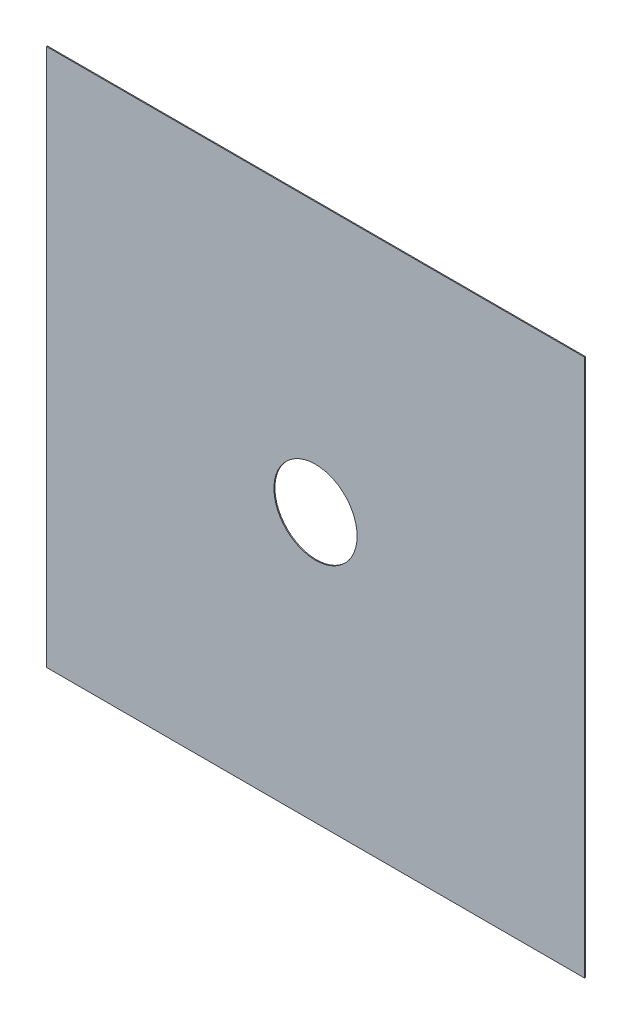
ISO-10303-21;
HEADER;
FILE_DESCRIPTION(('STEP AP214'),'2;1');
FILE_NAME('part.step','',(''),(''),'','','');
FILE_SCHEMA(('AUTOMOTIVE_DESIGN { 1 0 10303 214 1 1 1 1 }'));
ENDSEC;
DATA;
#1=APPLICATION_CONTEXT('core data for automotive mechanical design processes');
#2=APPLICATION_PROTOCOL_DEFINITION('international standard','automotive_design',2000,#1);
#3=PRODUCT_CONTEXT('',#1,'mechanical');
#4=PRODUCT('Part','Part','',(#3));
#5=PRODUCT_RELATED_PRODUCT_CATEGORY('part','',(#4));
#6=PRODUCT_DEFINITION_FORMATION('','',#4);
#7=PRODUCT_DEFINITION_CONTEXT('part definition',#1,'design');
#8=PRODUCT_DEFINITION('design','',#6,#7);
#9=PRODUCT_DEFINITION_SHAPE('','',#8);
#10=(LENGTH_UNIT() NAMED_UNIT(*) SI_UNIT(.MILLI.,.METRE.));
#11=(NAMED_UNIT(*) PLANE_ANGLE_UNIT() SI_UNIT($,.RADIAN.));
#12=(NAMED_UNIT(*) SI_UNIT($,.STERADIAN.) SOLID_ANGLE_UNIT());
#13=UNCERTAINTY_MEASURE_WITH_UNIT(LENGTH_MEASURE(1.E-05),#10,'distance_accuracy_value','');
#14=(GEOMETRIC_REPRESENTATION_CONTEXT(3) GLOBAL_UNCERTAINTY_ASSIGNED_CONTEXT((#13)) GLOBAL_UNIT_ASSIGNED_CONTEXT((#10,
#11,#12)) REPRESENTATION_CONTEXT('',''));
#15=CARTESIAN_POINT('',(0.,0.,0.));
#16=DIRECTION('',(0.,0.,1.));
#17=DIRECTION('',(1.,0.,0.));
#18=AXIS2_PLACEMENT_3D('',#15,#16,#17);
#19=CARTESIAN_POINT('',(0.,0.,3.));
#20=DIRECTION('',(0.,0.,1.));
#21=DIRECTION('',(1.,0.,0.));
#22=AXIS2_PLACEMENT_3D('',#19,#20,#21);
#23=PLANE('',#22);
#24=CARTESIAN_POINT('',(0.,0.,3.));
#25=DIRECTION('',(0.,0.,1.));
#26=DIRECTION('',(1.,0.,0.));
#27=AXIS2_PLACEMENT_3D('',#24,#25,#26);
#28=CIRCLE('',#27,130.);
#29=CARTESIAN_POINT('',(130.,0.,3.));
#30=VERTEX_POINT('',#29);
#31=EDGE_CURVE('E25',#30,#30,#28,.T.);
#32=ORIENTED_EDGE('',*,*,#31,.F.);
#33=EDGE_LOOP('',(#32));
#34=FACE_BOUND('',#33,.T.);
#35=DIRECTION('',(1.,0.,0.));
#36=VECTOR('',#35,1.);
#37=CARTESIAN_POINT('',(-841.,-841.,3.));
#38=LINE('',#37,#36);
#39=CARTESIAN_POINT('',(-841.,-841.,3.));
#40=VERTEX_POINT('',#39);
#41=CARTESIAN_POINT('',(841.,-841.,3.));
#42=VERTEX_POINT('',#41);
#43=EDGE_CURVE('E91',#40,#42,#38,.T.);
#44=ORIENTED_EDGE('',*,*,#43,.T.);
#45=DIRECTION('',(0.,1.,0.));
#46=VECTOR('',#45,1.);
#47=CARTESIAN_POINT('',(841.,-841.,3.));
#48=LINE('',#47,#46);
#49=CARTESIAN_POINT('',(841.,841.,3.));
#50=VERTEX_POINT('',#49);
#51=EDGE_CURVE('E118',#42,#50,#48,.T.);
#52=ORIENTED_EDGE('',*,*,#51,.T.);
#53=DIRECTION('',(-1.,0.,0.));
#54=VECTOR('',#53,1.);
#55=CARTESIAN_POINT('',(841.,841.,3.));
#56=LINE('',#55,#54);
#57=CARTESIAN_POINT('',(-841.,841.,3.));
#58=VERTEX_POINT('',#57);
#59=EDGE_CURVE('E84',#50,#58,#56,.T.);
#60=ORIENTED_EDGE('',*,*,#59,.T.);
#61=DIRECTION('',(0.,-1.,0.));
#62=VECTOR('',#61,1.);
#63=CARTESIAN_POINT('',(-841.,841.,3.));
#64=LINE('',#63,#62);
#65=EDGE_CURVE('E83',#58,#40,#64,.T.);
#66=ORIENTED_EDGE('',*,*,#65,.T.);
#67=EDGE_LOOP('',(#44,#52,#60,#66));
#68=FACE_BOUND('',#67,.T.);
#69=ADVANCED_FACE('F16',(#34,#68),#23,.T.);
#70=CARTESIAN_POINT('',(0.,0.,0.));
#71=DIRECTION('',(0.,0.,1.));
#72=DIRECTION('',(1.,0.,0.));
#73=AXIS2_PLACEMENT_3D('',#70,#71,#72);
#74=PLANE('',#73);
#75=CARTESIAN_POINT('',(0.,0.,0.));
#76=DIRECTION('',(0.,0.,1.));
#77=DIRECTION('',(1.,0.,0.));
#78=AXIS2_PLACEMENT_3D('',#75,#76,#77);
#79=CIRCLE('',#78,130.);
#80=CARTESIAN_POINT('',(130.,0.,0.));
#81=VERTEX_POINT('',#80);
#82=EDGE_CURVE('E10',#81,#81,#79,.T.);
#83=ORIENTED_EDGE('',*,*,#82,.T.);
#84=EDGE_LOOP('',(#83));
#85=FACE_BOUND('',#84,.T.);
#86=DIRECTION('',(0.,-1.,0.));
#87=VECTOR('',#86,1.);
#88=CARTESIAN_POINT('',(-841.,841.,0.));
#89=LINE('',#88,#87);
#90=CARTESIAN_POINT('',(-841.,841.,0.));
#91=VERTEX_POINT('',#90);
#92=CARTESIAN_POINT('',(-841.,-841.,0.));
#93=VERTEX_POINT('',#92);
#94=EDGE_CURVE('E72',#91,#93,#89,.T.);
#95=ORIENTED_EDGE('',*,*,#94,.F.);
#96=DIRECTION('',(-1.,0.,0.));
#97=VECTOR('',#96,1.);
#98=CARTESIAN_POINT('',(841.,841.,0.));
#99=LINE('',#98,#97);
#100=CARTESIAN_POINT('',(841.,841.,0.));
#101=VERTEX_POINT('',#100);
#102=EDGE_CURVE('E122',#101,#91,#99,.T.);
#103=ORIENTED_EDGE('',*,*,#102,.F.);
#104=DIRECTION('',(0.,1.,0.));
#105=VECTOR('',#104,1.);
#106=CARTESIAN_POINT('',(841.,-841.,0.));
#107=LINE('',#106,#105);
#108=CARTESIAN_POINT('',(841.,-841.,0.));
#109=VERTEX_POINT('',#108);
#110=EDGE_CURVE('E93',#109,#101,#107,.T.);
#111=ORIENTED_EDGE('',*,*,#110,.F.);
#112=DIRECTION('',(1.,0.,0.));
#113=VECTOR('',#112,1.);
#114=CARTESIAN_POINT('',(-841.,-841.,0.));
#115=LINE('',#114,#113);
#116=EDGE_CURVE('E89',#93,#109,#115,.T.);
#117=ORIENTED_EDGE('',*,*,#116,.F.);
#118=EDGE_LOOP('',(#95,#103,#111,#117));
#119=FACE_BOUND('',#118,.T.);
#120=ADVANCED_FACE('F95',(#85,#119),#74,.F.);
#121=CARTESIAN_POINT('',(0.,0.,0.));
#122=DIRECTION('',(0.,0.,-1.));
#123=DIRECTION('',(1.,0.,0.));
#124=AXIS2_PLACEMENT_3D('',#121,#122,#123);
#125=CYLINDRICAL_SURFACE('',#124,130.);
#126=DIRECTION('',(0.,0.,1.));
#127=VECTOR('',#126,1.);
#128=CARTESIAN_POINT('',(130.,0.,0.));
#129=LINE('',#128,#127);
#130=EDGE_CURVE('E106',#81,#30,#129,.T.);
#131=ORIENTED_EDGE('',*,*,#130,.T.);
#132=ORIENTED_EDGE('',*,*,#31,.T.);
#133=ORIENTED_EDGE('',*,*,#130,.F.);
#134=ORIENTED_EDGE('',*,*,#82,.F.);
#135=EDGE_LOOP('',(#131,#132,#133,#134));
#136=FACE_BOUND('',#135,.T.);
#137=ADVANCED_FACE('F134',(#136),#125,.F.);
#138=CARTESIAN_POINT('',(-841.,841.,0.));
#139=DIRECTION('',(1.,0.,0.));
#140=DIRECTION('',(0.,1.,0.));
#141=AXIS2_PLACEMENT_3D('',#138,#139,#140);
#142=PLANE('',#141);
#143=ORIENTED_EDGE('',*,*,#94,.T.);
#144=DIRECTION('',(0.,0.,1.));
#145=VECTOR('',#144,1.);
#146=CARTESIAN_POINT('',(-841.,-841.,0.));
#147=LINE('',#146,#145);
#148=EDGE_CURVE('E75',#93,#40,#147,.T.);
#149=ORIENTED_EDGE('',*,*,#148,.T.);
#150=ORIENTED_EDGE('',*,*,#65,.F.);
#151=DIRECTION('',(0.,0.,1.));
#152=VECTOR('',#151,1.);
#153=CARTESIAN_POINT('',(-841.,841.,0.));
#154=LINE('',#153,#152);
#155=EDGE_CURVE('E78',#91,#58,#154,.T.);
#156=ORIENTED_EDGE('',*,*,#155,.F.);
#157=EDGE_LOOP('',(#143,#149,#150,#156));
#158=FACE_BOUND('',#157,.T.);
#159=ADVANCED_FACE('F74',(#158),#142,.F.);
#160=CARTESIAN_POINT('',(841.,841.,0.));
#161=DIRECTION('',(0.,-1.,0.));
#162=DIRECTION('',(0.,0.,-1.));
#163=AXIS2_PLACEMENT_3D('',#160,#161,#162);
#164=PLANE('',#163);
#165=ORIENTED_EDGE('',*,*,#102,.T.);
#166=ORIENTED_EDGE('',*,*,#155,.T.);
#167=ORIENTED_EDGE('',*,*,#59,.F.);
#168=DIRECTION('',(0.,0.,1.));
#169=VECTOR('',#168,1.);
#170=CARTESIAN_POINT('',(841.,841.,0.));
#171=LINE('',#170,#169);
#172=EDGE_CURVE('E114',#101,#50,#171,.T.);
#173=ORIENTED_EDGE('',*,*,#172,.F.);
#174=EDGE_LOOP('',(#165,#166,#167,#173));
#175=FACE_BOUND('',#174,.T.);
#176=ADVANCED_FACE('F147',(#175),#164,.F.);
#177=CARTESIAN_POINT('',(841.,-841.,0.));
#178=DIRECTION('',(-1.,0.,0.));
#179=DIRECTION('',(0.,0.,1.));
#180=AXIS2_PLACEMENT_3D('',#177,#178,#179);
#181=PLANE('',#180);
#182=ORIENTED_EDGE('',*,*,#110,.T.);
#183=ORIENTED_EDGE('',*,*,#172,.T.);
#184=ORIENTED_EDGE('',*,*,#51,.F.);
#185=DIRECTION('',(0.,0.,1.));
#186=VECTOR('',#185,1.);
#187=CARTESIAN_POINT('',(841.,-841.,0.));
#188=LINE('',#187,#186);
#189=EDGE_CURVE('E99',#109,#42,#188,.T.);
#190=ORIENTED_EDGE('',*,*,#189,.F.);
#191=EDGE_LOOP('',(#182,#183,#184,#190));
#192=FACE_BOUND('',#191,.T.);
#193=ADVANCED_FACE('F150',(#192),#181,.F.);
#194=CARTESIAN_POINT('',(-841.,-841.,0.));
#195=DIRECTION('',(0.,1.,0.));
#196=DIRECTION('',(1.,0.,0.));
#197=AXIS2_PLACEMENT_3D('',#194,#195,#196);
#198=PLANE('',#197);
#199=ORIENTED_EDGE('',*,*,#116,.T.);
#200=ORIENTED_EDGE('',*,*,#189,.T.);
#201=ORIENTED_EDGE('',*,*,#43,.F.);
#202=ORIENTED_EDGE('',*,*,#148,.F.);
#203=EDGE_LOOP('',(#199,#200,#201,#202));
#204=FACE_BOUND('',#203,.T.);
#205=ADVANCED_FACE('F87',(#204),#198,.F.);
#206=CLOSED_SHELL('',(#69,#120,#137,#159,#176,#193,#205));
#207=MANIFOLD_SOLID_BREP('B1',#206);
#208=ADVANCED_BREP_SHAPE_REPRESENTATION('',(#18,#207),#14);
#209=SHAPE_DEFINITION_REPRESENTATION(#9,#208);
ENDSEC;
END-ISO-10303-21;
